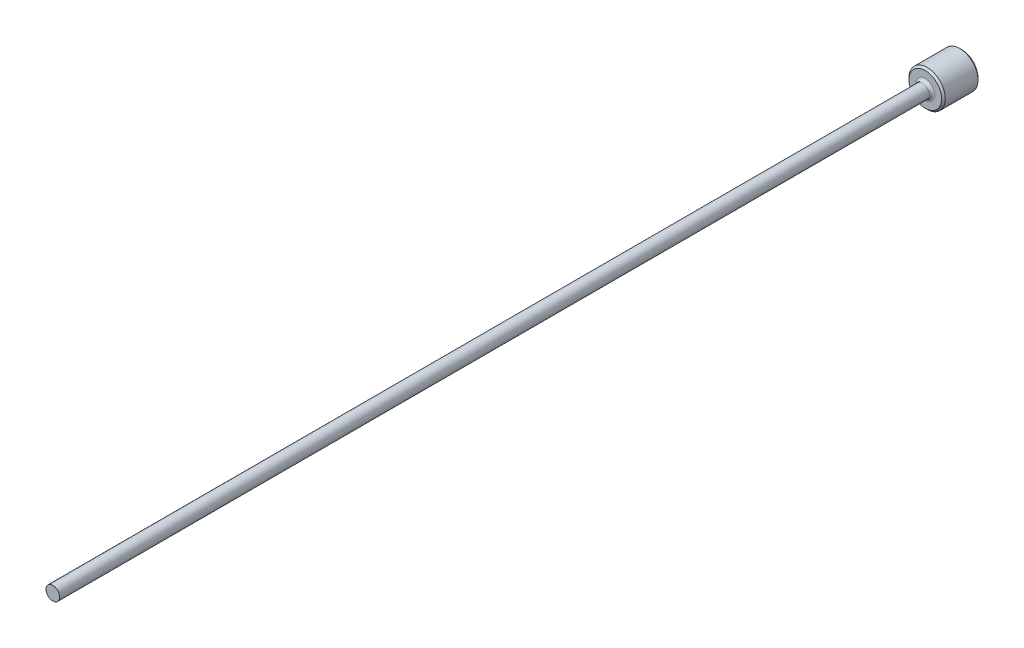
from build123d import *

# Parameters (mm, degrees)
CHAMFER1_SIZE = 0.2


with BuildPart() as part:
    # Sketch1 → Revolve1 (revolve)
    with BuildSketch(Plane(origin=(0, 0, 0), x_dir=(0, 0, -1), z_dir=(1, 0, 0)), mode=Mode.PRIVATE) as revolve1_sk:
        with BuildLine():
            Line((0, 0), (0, 2))
            Line((0, 2), (-4, 2))
            Line((-4, 2), (-4, 1.05))
            ThreePointArc((-4, 1.05), (-4.087867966, 0.837867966), (-4.3, 0.75))
            Line((-4.3, 0.75), (-100, 0.75))
            Line((-100, 0.75), (-100, 0))
            Line((-100, 0), (0, 0))
        make_face()
    revolve(revolve1_sk.sketch.rotate(Axis((0, 0, 109.05062828), (0, 0, -1)), 90), axis=Axis((0, 0, 109.05062828), (0, 0, -1)))

    # Chamfer1
    chamfer1_edges = [part.edges().sort_by_distance(p)[0] for p in [
        (-2, 0, 0),
        (-2, 0, 4),
    ]]
    chamfer(chamfer1_edges, length=CHAMFER1_SIZE)


solid = part.part
